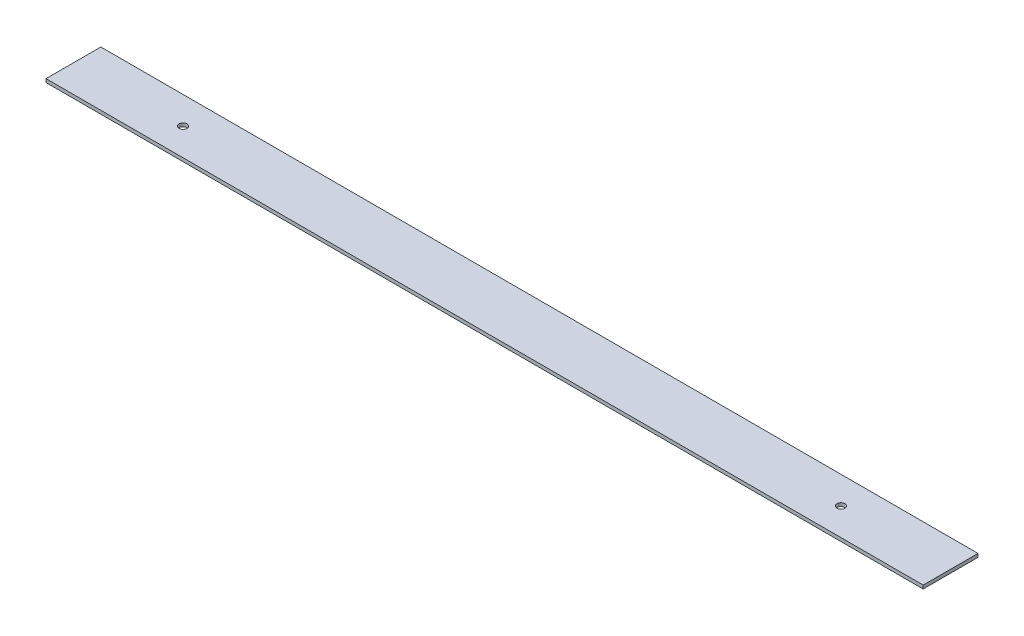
from build123d import *

# Parameters (mm, degrees)
SKETCH1_W                      = 1219.2
SKETCH1_H                      = 76.2
BOSS_EXTRUDE1_DEPTH            = 4.7625
F_7_16_0_4375_DIAMETER_HOLE1_D = 11.1125


with BuildPart() as part:
    # Sketch1 → Boss-Extrude1 (new body)
    with BuildSketch(Plane(origin=(0, 0, 0), x_dir=(1, 0, 0), z_dir=(0, 1, 0))):
        Rectangle(SKETCH1_W, SKETCH1_H)
    extrude(amount=BOSS_EXTRUDE1_DEPTH)

    # 7_16 _0.4375_ Diameter Hole1 (through all)
    with Locations(Plane(origin=(0, 4.7625, 0), x_dir=(1, 0, 0), z_dir=(0, 1, 0))):
        with Locations((-457.2, 0), (457.2, 0)):
            Hole(F_7_16_0_4375_DIAMETER_HOLE1_D / 2)


solid = part.part
